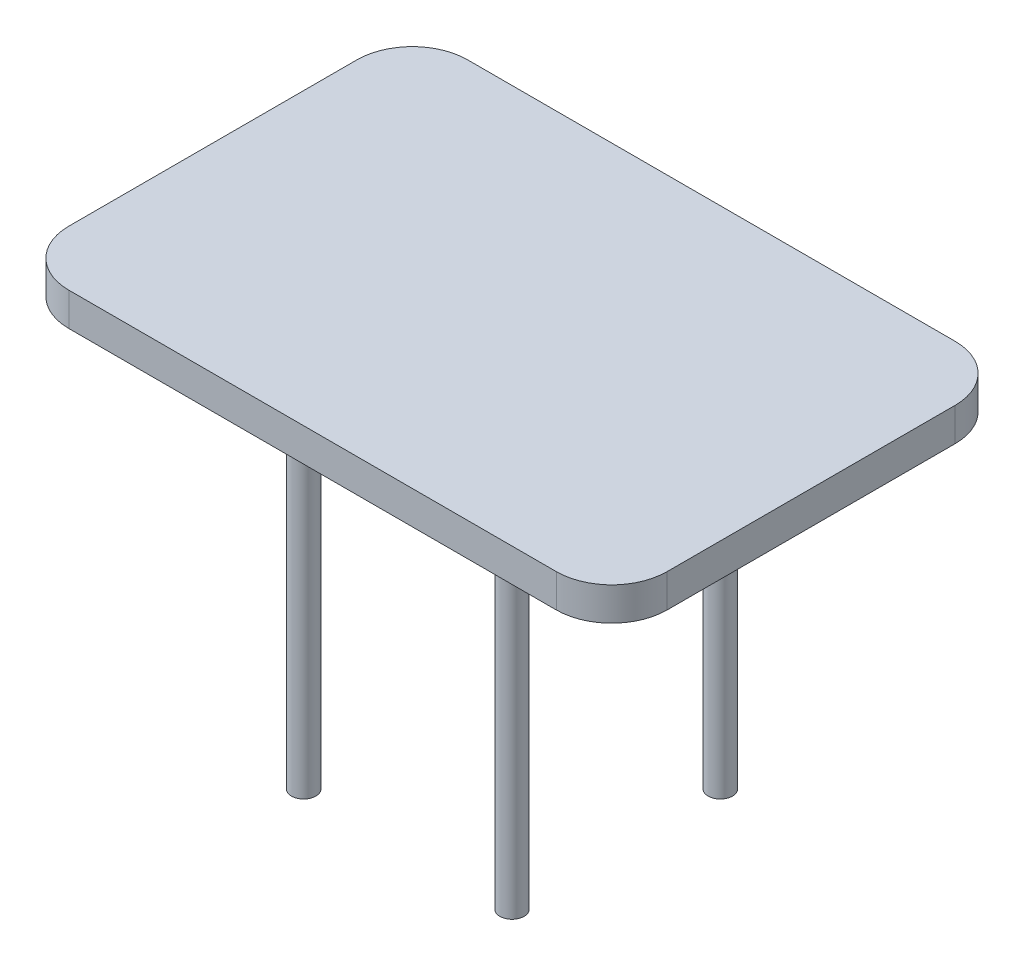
from build123d import *

# Parameters (mm, degrees)
SKETCH1_W      = 270
SKETCH1_H      = 180
EXTRUDE1_DEPTH = 15
SKETCH2_R      = 30
SKETCH2_R_2    = 15
EXTRUDE3_DEPTH = 25
CHAMFER1_SIZE  = 10
SKETCH3_R      = 5.5
EXTRUDE4_DEPTH = 170
SKETCH4_R      = 10.5
EXTRUDE5_DEPTH = 15
CHAMFER3_SIZE  = 2
FILLET1_R      = 25


with BuildPart() as part:
    # Sketch1 → Extrude1 (new body)
    with BuildSketch(Plane(origin=(0, 0, 0), x_dir=(1, 0, 0), z_dir=(0, 1, 0))):
        Rectangle(SKETCH1_W, SKETCH1_H)
    extrude(amount=-EXTRUDE1_DEPTH)

    # Sketch2 → Extrude3 (add)
    with BuildSketch(Plane.XZ.offset(15)):
        with Locations(Location((0, 0, 0), (0, 0, 90))):
            Circle(SKETCH2_R)
        with Locations(Location((0, 0, 0), (0, 0, 270))):
            Circle(SKETCH2_R_2, mode=Mode.SUBTRACT)
    extrude(amount=EXTRUDE3_DEPTH)

    # Chamfer1
    chamfer1_edges = [part.edges().sort_by_distance(p)[0] for p in [
        (0, -15, -30),
    ]]
    chamfer(chamfer1_edges, length=CHAMFER1_SIZE)

    # Sketch3 → Extrude4 (add)
    with BuildSketch(Plane.XZ.offset(15)):
        with Locations(Location((-47, 47, 0), (0, 0, 90))):
            Circle(SKETCH3_R)
        with Locations(Location((47, 47, 0), (0, 0, 90))):
            Circle(SKETCH3_R)
        with Locations(Location((47, -47, 0), (0, 0, 90))):
            Circle(SKETCH3_R)
        with Locations(Location((-47, -47, 0), (0, 0, 90))):
            Circle(SKETCH3_R)
    extrude(amount=EXTRUDE4_DEPTH)

    # Sketch4 → Extrude5 (add)
    with BuildSketch(Plane.XZ.offset(15)):
        with Locations(Location((-47, 47, 0), (0, 0, 90))):
            Circle(SKETCH4_R)
        with Locations(Location((-47, -47, 0), (0, 0, 90))):
            Circle(SKETCH4_R)
        with Locations(Location((47, -47, 0), (0, 0, 90))):
            Circle(SKETCH4_R)
        with Locations(Location((47, 47, 0), (0, 0, 90))):
            Circle(SKETCH4_R)
    extrude(amount=EXTRUDE5_DEPTH)

    # Chamfer3
    chamfer3_edges = [part.edges().sort_by_distance(p)[0] for p in [
        (-47, -30, -57.5),
        (47, -30, -57.5),
        (47, -30, 36.5),
        (-47, -30, 36.5),
    ]]
    chamfer(chamfer3_edges, length=CHAMFER3_SIZE)

    # Fillet1
    fillet1_edges = [part.edges().sort_by_distance(p)[0] for p in [
        (-135, -7.5, -90),
        (135, -7.5, -90),
        (135, -7.5, 90),
        (-135, -7.5, 90),
    ]]
    fillet(fillet1_edges, radius=FILLET1_R)


solid = part.part
